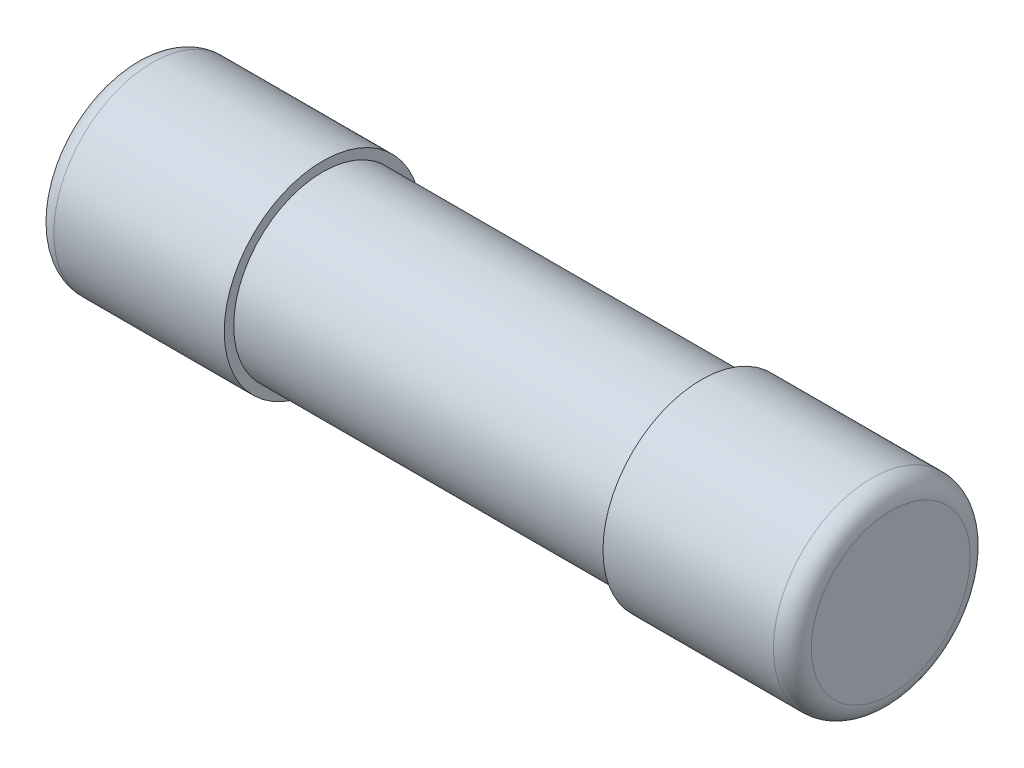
from build123d import *

# Parameters (mm, degrees)
SKETCH_1_W                 = 19
SKETCH_1_H                 = 0.2
EXTRUDE1_REACH             = 12.655
SKETCH1_R                  = 0.05
EXTRUDE1_DIRECTION_2_REACH = 12.655


with BuildPart() as part:
    # Sketch 1 → Revolve 1 (revolve)
    with BuildSketch(Plane.XY, mode=Mode.PRIVATE) as revolve_1_sk:
        with Locations((0, 2.25)):
            Rectangle(SKETCH_1_W, SKETCH_1_H)
    revolve(revolve_1_sk.sketch.rotate(Axis((-9.5, 0, 0), (1, 0, 0)), 90), axis=Axis((-9.5, 0, 0), (1, 0, 0)))

    # Sketch 2 → Revolve 4 (revolve)
    with BuildSketch(Plane.XY, mode=Mode.PRIVATE) as revolve_4_sk:
        with BuildLine():
            Line((-9.5, 2.35), (-9.5, 0))
            Line((-9.5, 0), (-10, 0))
            Line((-10, 0), (-10, 2.1))
            ThreePointArc((-10, 2.1), (-9.853553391, 2.453553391), (-9.5, 2.6))
            Line((-9.5, 2.6), (-5, 2.6))
            Line((-5, 2.6), (-5, 2.35))
            Line((-5, 2.35), (-9.5, 2.35))
        make_face()
        with BuildLine():
            Line((9.5, 0), (10, 0))
            Line((10, 0), (10, 2.1))
            ThreePointArc((10, 2.1), (9.853553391, 2.453553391), (9.5, 2.6))
            Line((9.5, 2.6), (5, 2.6))
            Line((5, 2.6), (5, 2.35))
            Line((5, 2.35), (9.5, 2.35))
            Line((9.5, 2.35), (9.5, 0))
        make_face()
    revolve(revolve_4_sk.sketch.rotate(Axis((-9.5, 0, 0), (1, 0, 0)), 90), axis=Axis((-9.5, 0, 0), (1, 0, 0)))

    # Extrude1: up to this face of the body (flat: up to its plane)
    extrude1_end = Plane(part.part.faces().sort_by_distance((9.5, 0, 0))[0])
    # Sketch1 → Extrude1 (add, up to the picked face)
    with BuildSketch(Plane(origin=(0, 0, 0), x_dir=(0, 0, -1), z_dir=(1, 0, 0)), mode=Mode.PRIVATE) as extrude1_sk1:
        with Locations(Location((0, 0, 0), (0, 0, 180))):
            Circle(SKETCH1_R)
    extrude1_tool1 = split(extrude(extrude1_sk1.sketch, amount=EXTRUDE1_REACH, mode=Mode.PRIVATE), bisect_by=extrude1_end, keep=Keep.BOTH, mode=Mode.PRIVATE)
    add(extrude1_tool1.solids().sort_by(Axis((0, 0, 0), (1, 0, 0)))[0])

    # Extrude1 direction 2: up to this face of the body (flat: up to its plane)
    extrude1_direction_2_end = Plane(part.part.faces().sort_by_distance((-9.5, 0, 0))[0])
    # Sketch1 → Extrude1 direction 2 (add, up to the picked face)
    with BuildSketch(Plane(origin=(0, 0, 0), x_dir=(0, 0, -1), z_dir=(1, 0, 0)), mode=Mode.PRIVATE) as extrude1_direction_2_sk1:
        with Locations(Location((0, 0, 0), (0, 0, 180))):
            Circle(SKETCH1_R)
    extrude1_direction_2_tool1 = split(extrude(extrude1_direction_2_sk1.sketch, amount=-EXTRUDE1_DIRECTION_2_REACH, mode=Mode.PRIVATE), bisect_by=extrude1_direction_2_end, keep=Keep.BOTH, mode=Mode.PRIVATE)
    add(extrude1_direction_2_tool1.solids().sort_by(Axis((0, 0, 0), (-1, 0, 0)))[0])


solid = part.part
